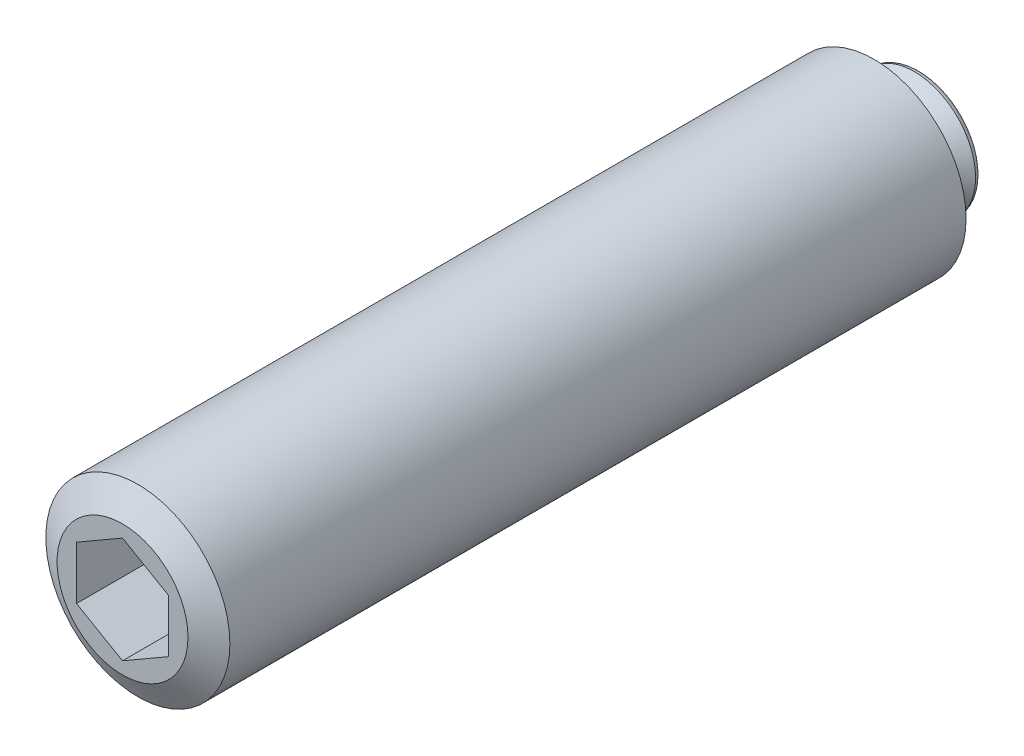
ISO-10303-21;
HEADER;
FILE_DESCRIPTION(('STEP AP214'),'2;1');
FILE_NAME('part.step','',(''),(''),'','','');
FILE_SCHEMA(('AUTOMOTIVE_DESIGN { 1 0 10303 214 1 1 1 1 }'));
ENDSEC;
DATA;
#1=APPLICATION_CONTEXT('core data for automotive mechanical design processes');
#2=APPLICATION_PROTOCOL_DEFINITION('international standard','automotive_design',2000,#1);
#3=PRODUCT_CONTEXT('',#1,'mechanical');
#4=PRODUCT('Part','Part','',(#3));
#5=PRODUCT_RELATED_PRODUCT_CATEGORY('part','',(#4));
#6=PRODUCT_DEFINITION_FORMATION('','',#4);
#7=PRODUCT_DEFINITION_CONTEXT('part definition',#1,'design');
#8=PRODUCT_DEFINITION('design','',#6,#7);
#9=PRODUCT_DEFINITION_SHAPE('','',#8);
#10=(LENGTH_UNIT() NAMED_UNIT(*) SI_UNIT(.MILLI.,.METRE.));
#11=(NAMED_UNIT(*) PLANE_ANGLE_UNIT() SI_UNIT($,.RADIAN.));
#12=(NAMED_UNIT(*) SI_UNIT($,.STERADIAN.) SOLID_ANGLE_UNIT());
#13=UNCERTAINTY_MEASURE_WITH_UNIT(LENGTH_MEASURE(1.E-05),#10,'distance_accuracy_value','');
#14=(GEOMETRIC_REPRESENTATION_CONTEXT(3) GLOBAL_UNCERTAINTY_ASSIGNED_CONTEXT((#13)) GLOBAL_UNIT_ASSIGNED_CONTEXT((#10,
#11,#12)) REPRESENTATION_CONTEXT('',''));
#15=CARTESIAN_POINT('',(0.,0.,0.));
#16=DIRECTION('',(0.,0.,1.));
#17=DIRECTION('',(1.,0.,0.));
#18=AXIS2_PLACEMENT_3D('',#15,#16,#17);
#19=CARTESIAN_POINT('',(0.,4.267949,52.));
#20=DIRECTION('',(0.,0.,1.));
#21=DIRECTION('',(1.,0.,0.));
#22=AXIS2_PLACEMENT_3D('',#19,#20,#21);
#23=PLANE('',#22);
#24=DIRECTION('',(-0.866025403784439,0.5,0.));
#25=VECTOR('',#24,1.);
#26=CARTESIAN_POINT('',(3.,1.73205080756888,52.));
#27=LINE('',#26,#25);
#28=CARTESIAN_POINT('',(3.,1.73205080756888,52.));
#29=VERTEX_POINT('',#28);
#30=CARTESIAN_POINT('',(0.,3.46410161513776,52.));
#31=VERTEX_POINT('',#30);
#32=EDGE_CURVE('E28',#29,#31,#27,.T.);
#33=ORIENTED_EDGE('',*,*,#32,.F.);
#34=DIRECTION('',(0.,1.,0.));
#35=VECTOR('',#34,1.);
#36=CARTESIAN_POINT('',(3.,-1.73205080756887,52.));
#37=LINE('',#36,#35);
#38=CARTESIAN_POINT('',(3.,-1.73205080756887,52.));
#39=VERTEX_POINT('',#38);
#40=EDGE_CURVE('E111',#39,#29,#37,.T.);
#41=ORIENTED_EDGE('',*,*,#40,.F.);
#42=DIRECTION('',(0.866025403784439,0.5,0.));
#43=VECTOR('',#42,1.);
#44=CARTESIAN_POINT('',(0.,-3.46410161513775,52.));
#45=LINE('',#44,#43);
#46=CARTESIAN_POINT('',(0.,-3.46410161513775,52.));
#47=VERTEX_POINT('',#46);
#48=EDGE_CURVE('E109',#47,#39,#45,.T.);
#49=ORIENTED_EDGE('',*,*,#48,.F.);
#50=DIRECTION('',(0.866025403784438,-0.5,0.));
#51=VECTOR('',#50,1.);
#52=CARTESIAN_POINT('',(-3.,-1.73205080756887,52.));
#53=LINE('',#52,#51);
#54=CARTESIAN_POINT('',(-3.,-1.73205080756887,52.));
#55=VERTEX_POINT('',#54);
#56=EDGE_CURVE('E76',#55,#47,#53,.T.);
#57=ORIENTED_EDGE('',*,*,#56,.F.);
#58=DIRECTION('',(0.,-1.,0.));
#59=VECTOR('',#58,1.);
#60=CARTESIAN_POINT('',(-3.,1.73205080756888,52.));
#61=LINE('',#60,#59);
#62=CARTESIAN_POINT('',(-3.,1.73205080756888,52.));
#63=VERTEX_POINT('',#62);
#64=EDGE_CURVE('E105',#63,#55,#61,.T.);
#65=ORIENTED_EDGE('',*,*,#64,.F.);
#66=DIRECTION('',(-0.866025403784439,-0.5,0.));
#67=VECTOR('',#66,1.);
#68=CARTESIAN_POINT('',(0.,3.46410161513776,52.));
#69=LINE('',#68,#67);
#70=EDGE_CURVE('E102',#31,#63,#69,.T.);
#71=ORIENTED_EDGE('',*,*,#70,.F.);
#72=EDGE_LOOP('',(#33,#41,#49,#57,#65,#71));
#73=FACE_BOUND('',#72,.T.);
#74=CARTESIAN_POINT('',(0.,0.,52.));
#75=DIRECTION('',(0.,0.,1.));
#76=DIRECTION('',(1.,0.,0.));
#77=AXIS2_PLACEMENT_3D('',#74,#75,#76);
#78=CIRCLE('',#77,4.267949);
#79=CARTESIAN_POINT('',(4.267949,0.,52.));
#80=VERTEX_POINT('',#79);
#81=EDGE_CURVE('E9',#80,#80,#78,.T.);
#82=ORIENTED_EDGE('',*,*,#81,.T.);
#83=EDGE_LOOP('',(#82));
#84=FACE_BOUND('',#83,.T.);
#85=ADVANCED_FACE('F14',(#73,#84),#23,.T.);
#86=CARTESIAN_POINT('',(0.,0.,52.));
#87=DIRECTION('',(0.,0.,-1.));
#88=DIRECTION('',(-1.,0.,0.));
#89=AXIS2_PLACEMENT_3D('',#86,#87,#88);
#90=CONICAL_SURFACE('',#89,4.267949,1.04719759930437);
#91=CARTESIAN_POINT('',(0.,0.,51.));
#92=DIRECTION('',(0.,0.,1.));
#93=DIRECTION('',(1.,0.,0.));
#94=AXIS2_PLACEMENT_3D('',#91,#92,#93);
#95=CIRCLE('',#94,6.);
#96=CARTESIAN_POINT('',(6.,0.,51.));
#97=VERTEX_POINT('',#96);
#98=EDGE_CURVE('E21',#97,#97,#95,.T.);
#99=ORIENTED_EDGE('',*,*,#98,.T.);
#100=EDGE_LOOP('',(#99));
#101=FACE_BOUND('',#100,.T.);
#102=ORIENTED_EDGE('',*,*,#81,.F.);
#103=EDGE_LOOP('',(#102));
#104=FACE_BOUND('',#103,.T.);
#105=ADVANCED_FACE('F143',(#101,#104),#90,.T.);
#106=CARTESIAN_POINT('',(0.,0.,55.));
#107=DIRECTION('',(0.,0.,1.));
#108=DIRECTION('',(1.,0.,0.));
#109=AXIS2_PLACEMENT_3D('',#106,#107,#108);
#110=CYLINDRICAL_SURFACE('',#109,6.);
#111=CARTESIAN_POINT('',(0.,0.,3.));
#112=DIRECTION('',(0.,0.,1.));
#113=DIRECTION('',(1.,0.,0.));
#114=AXIS2_PLACEMENT_3D('',#111,#112,#113);
#115=CIRCLE('',#114,6.);
#116=CARTESIAN_POINT('',(6.,0.,3.));
#117=VERTEX_POINT('',#116);
#118=EDGE_CURVE('E138',#117,#117,#115,.T.);
#119=ORIENTED_EDGE('',*,*,#118,.T.);
#120=EDGE_LOOP('',(#119));
#121=FACE_BOUND('',#120,.T.);
#122=ORIENTED_EDGE('',*,*,#98,.F.);
#123=EDGE_LOOP('',(#122));
#124=FACE_BOUND('',#123,.T.);
#125=ADVANCED_FACE('F146',(#121,#124),#110,.T.);
#126=CARTESIAN_POINT('',(0.,0.,3.));
#127=DIRECTION('',(0.,0.,1.));
#128=DIRECTION('',(1.,0.,0.));
#129=AXIS2_PLACEMENT_3D('',#126,#127,#128);
#130=CONICAL_SURFACE('',#129,6.,1.04719759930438);
#131=CARTESIAN_POINT('',(0.,0.,2.));
#132=DIRECTION('',(0.,0.,1.));
#133=DIRECTION('',(1.,0.,0.));
#134=AXIS2_PLACEMENT_3D('',#131,#132,#133);
#135=CIRCLE('',#134,4.267949);
#136=CARTESIAN_POINT('',(4.267949,0.,2.));
#137=VERTEX_POINT('',#136);
#138=EDGE_CURVE('E135',#137,#137,#135,.T.);
#139=ORIENTED_EDGE('',*,*,#138,.T.);
#140=EDGE_LOOP('',(#139));
#141=FACE_BOUND('',#140,.T.);
#142=ORIENTED_EDGE('',*,*,#118,.F.);
#143=EDGE_LOOP('',(#142));
#144=FACE_BOUND('',#143,.T.);
#145=ADVANCED_FACE('F148',(#141,#144),#130,.T.);
#146=CARTESIAN_POINT('',(0.,4.267949,2.));
#147=DIRECTION('',(0.,0.,-1.));
#148=DIRECTION('',(-1.,0.,0.));
#149=AXIS2_PLACEMENT_3D('',#146,#147,#148);
#150=PLANE('',#149);
#151=CARTESIAN_POINT('',(0.,0.,2.));
#152=DIRECTION('',(0.,0.,1.));
#153=DIRECTION('',(1.,0.,0.));
#154=AXIS2_PLACEMENT_3D('',#151,#152,#153);
#155=CIRCLE('',#154,3.);
#156=CARTESIAN_POINT('',(3.,0.,2.));
#157=VERTEX_POINT('',#156);
#158=EDGE_CURVE('E132',#157,#157,#155,.T.);
#159=ORIENTED_EDGE('',*,*,#158,.T.);
#160=EDGE_LOOP('',(#159));
#161=FACE_BOUND('',#160,.T.);
#162=ORIENTED_EDGE('',*,*,#138,.F.);
#163=EDGE_LOOP('',(#162));
#164=FACE_BOUND('',#163,.T.);
#165=ADVANCED_FACE('F157',(#161,#164),#150,.T.);
#166=CARTESIAN_POINT('',(0.,0.,55.));
#167=DIRECTION('',(0.,0.,1.));
#168=DIRECTION('',(1.,0.,0.));
#169=AXIS2_PLACEMENT_3D('',#166,#167,#168);
#170=CYLINDRICAL_SURFACE('',#169,3.);
#171=CARTESIAN_POINT('',(0.,0.,1.4862102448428));
#172=DIRECTION('',(0.,0.,1.));
#173=DIRECTION('',(1.,0.,0.));
#174=AXIS2_PLACEMENT_3D('',#171,#172,#173);
#175=CIRCLE('',#174,3.);
#176=CARTESIAN_POINT('',(3.,0.,1.4862102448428));
#177=VERTEX_POINT('',#176);
#178=EDGE_CURVE('E129',#177,#177,#175,.T.);
#179=ORIENTED_EDGE('',*,*,#178,.T.);
#180=EDGE_LOOP('',(#179));
#181=FACE_BOUND('',#180,.T.);
#182=ORIENTED_EDGE('',*,*,#158,.F.);
#183=EDGE_LOOP('',(#182));
#184=FACE_BOUND('',#183,.T.);
#185=ADVANCED_FACE('F200',(#181,#184),#170,.T.);
#186=CARTESIAN_POINT('',(0.,0.,1.4862102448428));
#187=DIRECTION('',(0.,0.,1.));
#188=DIRECTION('',(1.,0.,0.));
#189=AXIS2_PLACEMENT_3D('',#186,#187,#188);
#190=TOROIDAL_SURFACE('',#189,3.254,0.254000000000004);
#191=CARTESIAN_POINT('',(0.,0.,1.30660512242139));
#192=DIRECTION('',(0.,0.,1.));
#193=DIRECTION('',(1.,0.,0.));
#194=AXIS2_PLACEMENT_3D('',#191,#192,#193);
#195=CIRCLE('',#194,3.07439487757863);
#196=CARTESIAN_POINT('',(3.07439487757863,0.,1.30660512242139));
#197=VERTEX_POINT('',#196);
#198=EDGE_CURVE('E126',#197,#197,#195,.T.);
#199=ORIENTED_EDGE('',*,*,#198,.T.);
#200=EDGE_LOOP('',(#199));
#201=FACE_BOUND('',#200,.T.);
#202=ORIENTED_EDGE('',*,*,#178,.F.);
#203=EDGE_LOOP('',(#202));
#204=FACE_BOUND('',#203,.T.);
#205=ADVANCED_FACE('F196',(#201,#204),#190,.F.);
#206=CARTESIAN_POINT('',(0.,0.,1.30660512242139));
#207=DIRECTION('',(0.,0.,-1.));
#208=DIRECTION('',(-1.,0.,0.));
#209=AXIS2_PLACEMENT_3D('',#206,#207,#208);
#210=CONICAL_SURFACE('',#209,3.07439487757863,0.785398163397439);
#211=CARTESIAN_POINT('',(0.,0.,0.381));
#212=DIRECTION('',(0.,0.,1.));
#213=DIRECTION('',(1.,0.,0.));
#214=AXIS2_PLACEMENT_3D('',#211,#212,#213);
#215=CIRCLE('',#214,4.);
#216=CARTESIAN_POINT('',(4.,0.,0.381));
#217=VERTEX_POINT('',#216);
#218=EDGE_CURVE('E123',#217,#217,#215,.T.);
#219=ORIENTED_EDGE('',*,*,#218,.T.);
#220=EDGE_LOOP('',(#219));
#221=FACE_BOUND('',#220,.T.);
#222=ORIENTED_EDGE('',*,*,#198,.F.);
#223=EDGE_LOOP('',(#222));
#224=FACE_BOUND('',#223,.T.);
#225=ADVANCED_FACE('F192',(#221,#224),#210,.T.);
#226=CARTESIAN_POINT('',(0.,0.,0.381));
#227=DIRECTION('',(0.,0.,1.));
#228=DIRECTION('',(1.,0.,0.));
#229=AXIS2_PLACEMENT_3D('',#226,#227,#228);
#230=TOROIDAL_SURFACE('',#229,3.619,0.381);
#231=CARTESIAN_POINT('',(0.,0.,0.));
#232=DIRECTION('',(0.,0.,1.));
#233=DIRECTION('',(1.,0.,0.));
#234=AXIS2_PLACEMENT_3D('',#231,#232,#233);
#235=CIRCLE('',#234,3.619);
#236=CARTESIAN_POINT('',(3.619,0.,0.));
#237=VERTEX_POINT('',#236);
#238=EDGE_CURVE('E115',#237,#237,#235,.T.);
#239=ORIENTED_EDGE('',*,*,#238,.T.);
#240=EDGE_LOOP('',(#239));
#241=FACE_BOUND('',#240,.T.);
#242=ORIENTED_EDGE('',*,*,#218,.F.);
#243=EDGE_LOOP('',(#242));
#244=FACE_BOUND('',#243,.T.);
#245=ADVANCED_FACE('F184',(#241,#244),#230,.T.);
#246=CARTESIAN_POINT('',(0.,0.,0.));
#247=DIRECTION('',(0.,0.,-1.));
#248=DIRECTION('',(-1.,0.,0.));
#249=AXIS2_PLACEMENT_3D('',#246,#247,#248);
#250=PLANE('',#249);
#251=ORIENTED_EDGE('',*,*,#238,.F.);
#252=EDGE_LOOP('',(#251));
#253=FACE_BOUND('',#252,.T.);
#254=ADVANCED_FACE('F176',(#253),#250,.T.);
#255=CARTESIAN_POINT('',(3.,1.73205080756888,47.));
#256=DIRECTION('',(0.5,0.866025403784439,0.));
#257=DIRECTION('',(-0.866025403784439,0.5,0.));
#258=AXIS2_PLACEMENT_3D('',#255,#256,#257);
#259=PLANE('',#258);
#260=ORIENTED_EDGE('',*,*,#32,.T.);
#261=DIRECTION('',(0.,0.,1.));
#262=VECTOR('',#261,1.);
#263=CARTESIAN_POINT('',(0.,3.46410161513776,47.));
#264=LINE('',#263,#262);
#265=CARTESIAN_POINT('',(0.,3.46410161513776,47.));
#266=VERTEX_POINT('',#265);
#267=EDGE_CURVE('E58',#266,#31,#264,.T.);
#268=ORIENTED_EDGE('',*,*,#267,.F.);
#269=DIRECTION('',(-0.866025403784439,0.5,0.));
#270=VECTOR('',#269,1.);
#271=CARTESIAN_POINT('',(3.,1.73205080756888,47.));
#272=LINE('',#271,#270);
#273=CARTESIAN_POINT('',(3.,1.73205080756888,47.));
#274=VERTEX_POINT('',#273);
#275=EDGE_CURVE('E113',#274,#266,#272,.T.);
#276=ORIENTED_EDGE('',*,*,#275,.F.);
#277=DIRECTION('',(0.,0.,1.));
#278=VECTOR('',#277,1.);
#279=CARTESIAN_POINT('',(3.,1.73205080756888,47.));
#280=LINE('',#279,#278);
#281=EDGE_CURVE('E36',#274,#29,#280,.T.);
#282=ORIENTED_EDGE('',*,*,#281,.T.);
#283=EDGE_LOOP('',(#260,#268,#276,#282));
#284=FACE_BOUND('',#283,.T.);
#285=ADVANCED_FACE('F173',(#284),#259,.F.);
#286=CARTESIAN_POINT('',(3.,-1.73205080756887,47.));
#287=DIRECTION('',(1.,0.,0.));
#288=DIRECTION('',(0.,0.,-1.));
#289=AXIS2_PLACEMENT_3D('',#286,#287,#288);
#290=PLANE('',#289);
#291=ORIENTED_EDGE('',*,*,#40,.T.);
#292=ORIENTED_EDGE('',*,*,#281,.F.);
#293=DIRECTION('',(0.,1.,0.));
#294=VECTOR('',#293,1.);
#295=CARTESIAN_POINT('',(3.,-1.73205080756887,47.));
#296=LINE('',#295,#294);
#297=CARTESIAN_POINT('',(3.,-1.73205080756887,47.));
#298=VERTEX_POINT('',#297);
#299=EDGE_CURVE('E88',#298,#274,#296,.T.);
#300=ORIENTED_EDGE('',*,*,#299,.F.);
#301=DIRECTION('',(0.,0.,1.));
#302=VECTOR('',#301,1.);
#303=CARTESIAN_POINT('',(3.,-1.73205080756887,47.));
#304=LINE('',#303,#302);
#305=EDGE_CURVE('E80',#298,#39,#304,.T.);
#306=ORIENTED_EDGE('',*,*,#305,.T.);
#307=EDGE_LOOP('',(#291,#292,#300,#306));
#308=FACE_BOUND('',#307,.T.);
#309=ADVANCED_FACE('F175',(#308),#290,.F.);
#310=CARTESIAN_POINT('',(0.,-3.46410161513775,47.));
#311=DIRECTION('',(0.5,-0.866025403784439,0.));
#312=DIRECTION('',(0.866025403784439,0.5,0.));
#313=AXIS2_PLACEMENT_3D('',#310,#311,#312);
#314=PLANE('',#313);
#315=ORIENTED_EDGE('',*,*,#48,.T.);
#316=ORIENTED_EDGE('',*,*,#305,.F.);
#317=DIRECTION('',(0.866025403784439,0.5,0.));
#318=VECTOR('',#317,1.);
#319=CARTESIAN_POINT('',(0.,-3.46410161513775,47.));
#320=LINE('',#319,#318);
#321=CARTESIAN_POINT('',(0.,-3.46410161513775,47.));
#322=VERTEX_POINT('',#321);
#323=EDGE_CURVE('E84',#322,#298,#320,.T.);
#324=ORIENTED_EDGE('',*,*,#323,.F.);
#325=DIRECTION('',(0.,0.,1.));
#326=VECTOR('',#325,1.);
#327=CARTESIAN_POINT('',(0.,-3.46410161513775,47.));
#328=LINE('',#327,#326);
#329=EDGE_CURVE('E69',#322,#47,#328,.T.);
#330=ORIENTED_EDGE('',*,*,#329,.T.);
#331=EDGE_LOOP('',(#315,#316,#324,#330));
#332=FACE_BOUND('',#331,.T.);
#333=ADVANCED_FACE('F85',(#332),#314,.F.);
#334=CARTESIAN_POINT('',(-3.,-1.73205080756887,47.));
#335=DIRECTION('',(-0.5,-0.866025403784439,0.));
#336=DIRECTION('',(0.866025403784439,-0.5,0.));
#337=AXIS2_PLACEMENT_3D('',#334,#335,#336);
#338=PLANE('',#337);
#339=ORIENTED_EDGE('',*,*,#56,.T.);
#340=ORIENTED_EDGE('',*,*,#329,.F.);
#341=DIRECTION('',(0.866025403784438,-0.5,0.));
#342=VECTOR('',#341,1.);
#343=CARTESIAN_POINT('',(-3.,-1.73205080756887,47.));
#344=LINE('',#343,#342);
#345=CARTESIAN_POINT('',(-3.,-1.73205080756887,47.));
#346=VERTEX_POINT('',#345);
#347=EDGE_CURVE('E73',#346,#322,#344,.T.);
#348=ORIENTED_EDGE('',*,*,#347,.F.);
#349=DIRECTION('',(0.,0.,1.));
#350=VECTOR('',#349,1.);
#351=CARTESIAN_POINT('',(-3.,-1.73205080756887,47.));
#352=LINE('',#351,#350);
#353=EDGE_CURVE('E81',#346,#55,#352,.T.);
#354=ORIENTED_EDGE('',*,*,#353,.T.);
#355=EDGE_LOOP('',(#339,#340,#348,#354));
#356=FACE_BOUND('',#355,.T.);
#357=ADVANCED_FACE('F71',(#356),#338,.F.);
#358=CARTESIAN_POINT('',(-3.,1.73205080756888,47.));
#359=DIRECTION('',(-1.,0.,0.));
#360=DIRECTION('',(0.,0.,1.));
#361=AXIS2_PLACEMENT_3D('',#358,#359,#360);
#362=PLANE('',#361);
#363=ORIENTED_EDGE('',*,*,#64,.T.);
#364=ORIENTED_EDGE('',*,*,#353,.F.);
#365=DIRECTION('',(0.,-1.,0.));
#366=VECTOR('',#365,1.);
#367=CARTESIAN_POINT('',(-3.,1.73205080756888,47.));
#368=LINE('',#367,#366);
#369=CARTESIAN_POINT('',(-3.,1.73205080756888,47.));
#370=VERTEX_POINT('',#369);
#371=EDGE_CURVE('E94',#370,#346,#368,.T.);
#372=ORIENTED_EDGE('',*,*,#371,.F.);
#373=DIRECTION('',(0.,0.,1.));
#374=VECTOR('',#373,1.);
#375=CARTESIAN_POINT('',(-3.,1.73205080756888,47.));
#376=LINE('',#375,#374);
#377=EDGE_CURVE('E118',#370,#63,#376,.T.);
#378=ORIENTED_EDGE('',*,*,#377,.T.);
#379=EDGE_LOOP('',(#363,#364,#372,#378));
#380=FACE_BOUND('',#379,.T.);
#381=ADVANCED_FACE('F295',(#380),#362,.F.);
#382=CARTESIAN_POINT('',(0.,3.46410161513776,47.));
#383=DIRECTION('',(-0.5,0.866025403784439,0.));
#384=DIRECTION('',(-0.866025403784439,-0.5,0.));
#385=AXIS2_PLACEMENT_3D('',#382,#383,#384);
#386=PLANE('',#385);
#387=ORIENTED_EDGE('',*,*,#70,.T.);
#388=ORIENTED_EDGE('',*,*,#377,.F.);
#389=DIRECTION('',(-0.866025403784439,-0.5,0.));
#390=VECTOR('',#389,1.);
#391=CARTESIAN_POINT('',(0.,3.46410161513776,47.));
#392=LINE('',#391,#390);
#393=EDGE_CURVE('E96',#266,#370,#392,.T.);
#394=ORIENTED_EDGE('',*,*,#393,.F.);
#395=ORIENTED_EDGE('',*,*,#267,.T.);
#396=EDGE_LOOP('',(#387,#388,#394,#395));
#397=FACE_BOUND('',#396,.T.);
#398=ADVANCED_FACE('F171',(#397),#386,.F.);
#399=CARTESIAN_POINT('',(0.,3.46410161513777,47.));
#400=DIRECTION('',(0.,0.,1.));
#401=DIRECTION('',(1.,0.,0.));
#402=AXIS2_PLACEMENT_3D('',#399,#400,#401);
#403=PLANE('',#402);
#404=ORIENTED_EDGE('',*,*,#275,.T.);
#405=ORIENTED_EDGE('',*,*,#393,.T.);
#406=ORIENTED_EDGE('',*,*,#371,.T.);
#407=ORIENTED_EDGE('',*,*,#347,.T.);
#408=ORIENTED_EDGE('',*,*,#323,.T.);
#409=ORIENTED_EDGE('',*,*,#299,.T.);
#410=EDGE_LOOP('',(#404,#405,#406,#407,#408,#409));
#411=FACE_BOUND('',#410,.T.);
#412=ADVANCED_FACE('F91',(#411),#403,.T.);
#413=CLOSED_SHELL('',(#85,#105,#125,#145,#165,#185,#205,#225,#245,#254,#285,#309,#333,#357,#381,
#398,#412));
#414=MANIFOLD_SOLID_BREP('B1',#413);
#415=ADVANCED_BREP_SHAPE_REPRESENTATION('',(#18,#414),#14);
#416=SHAPE_DEFINITION_REPRESENTATION(#9,#415);
ENDSEC;
END-ISO-10303-21;
